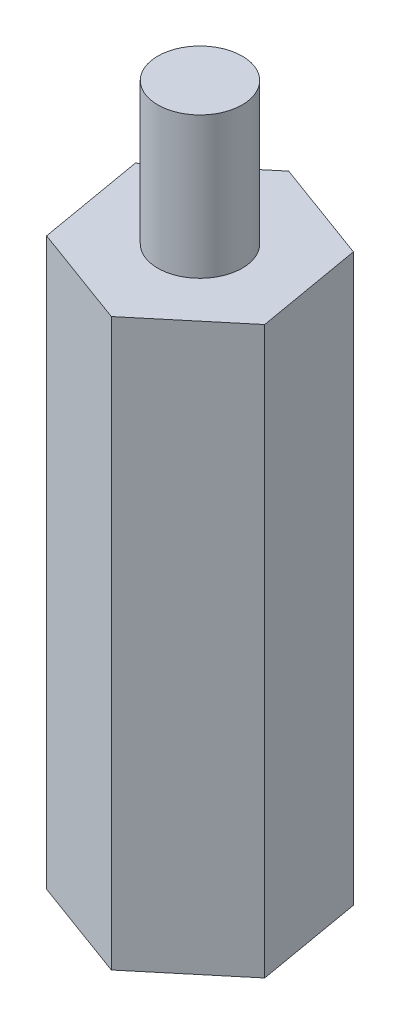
from build123d import *

# Parameters (mm, degrees)
EXTRUDE1_DEPTH     = 19.05
SKETCH2_R          = 1.4224
EXTRUDE2_DEPTH     = 4.7625
SKETCH3_R          = 1.4224
CUT_EXTRUDE1_DEPTH = 5.08


with BuildPart() as part:
    # Sketch1 → Extrude1 (new body)
    with BuildSketch(Plane(origin=(0, 0, 0), x_dir=(1, 0, 0), z_dir=(0, 1, 0))):
        Polygon((-0.626611, 3.61222812), (-3.441586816, 1.263453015), (-2.814975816, -2.348775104), (0.626611, -3.61222812), (3.441586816, -1.263453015), (2.814975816, 2.348775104), align=None)
    extrude(amount=EXTRUDE1_DEPTH)

    # Sketch2 → Extrude2 (add)
    with BuildSketch(Plane(origin=(0, 19.05, 0), x_dir=(-1, 0, 0), z_dir=(0, 1, 0))):
        with Locations(Location((0, 0, 0), (0, 0, 270))):
            Circle(SKETCH2_R)
    extrude(amount=EXTRUDE2_DEPTH)

    # Sketch3 → Cut-Extrude1 (cut)
    with BuildSketch(Plane.XZ):
        with Locations(Location((0, 0, 0), (0, 0, 270))):
            Circle(SKETCH3_R)
    extrude(amount=-CUT_EXTRUDE1_DEPTH, mode=Mode.SUBTRACT)


solid = part.part
